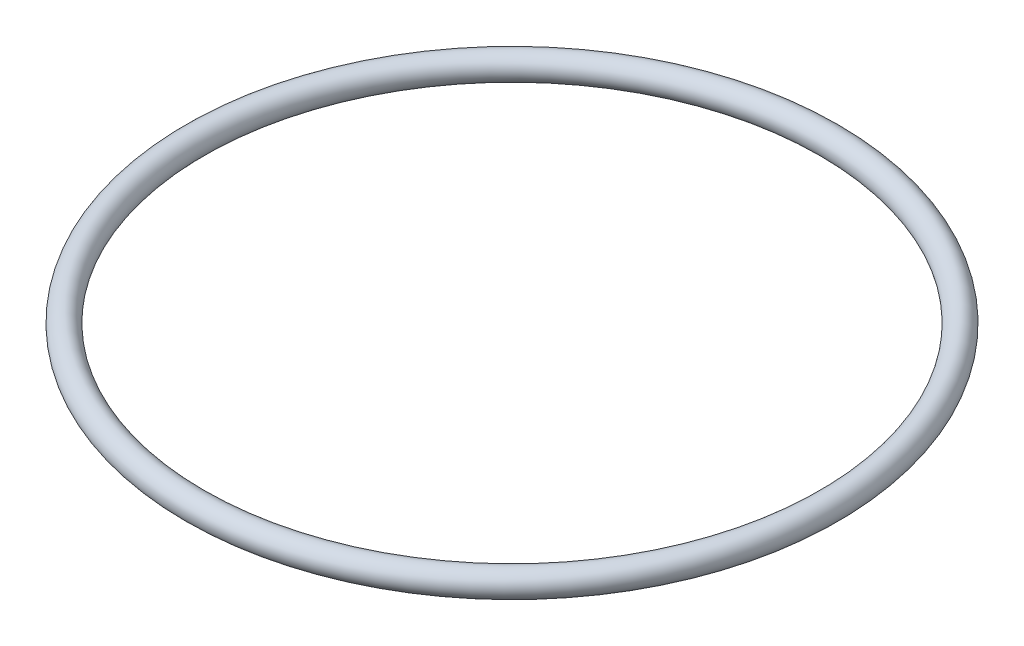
from build123d import *

# Parameters (mm, degrees)
SKETCH1_R = 1.984375


with BuildPart() as part:
    # Sketch1 → Revolve1 (revolve)
    with BuildSketch(Plane.XY, mode=Mode.PRIVATE) as revolve1_sk:
        with Locations((49.53, 0.785481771)):
            Circle(SKETCH1_R)
    revolve(revolve1_sk.sketch.rotate(Axis((0, 0, 0), (0, 1, 0)), 90), axis=Axis((0, 0, 0), (0, 1, 0)))


solid = part.part
